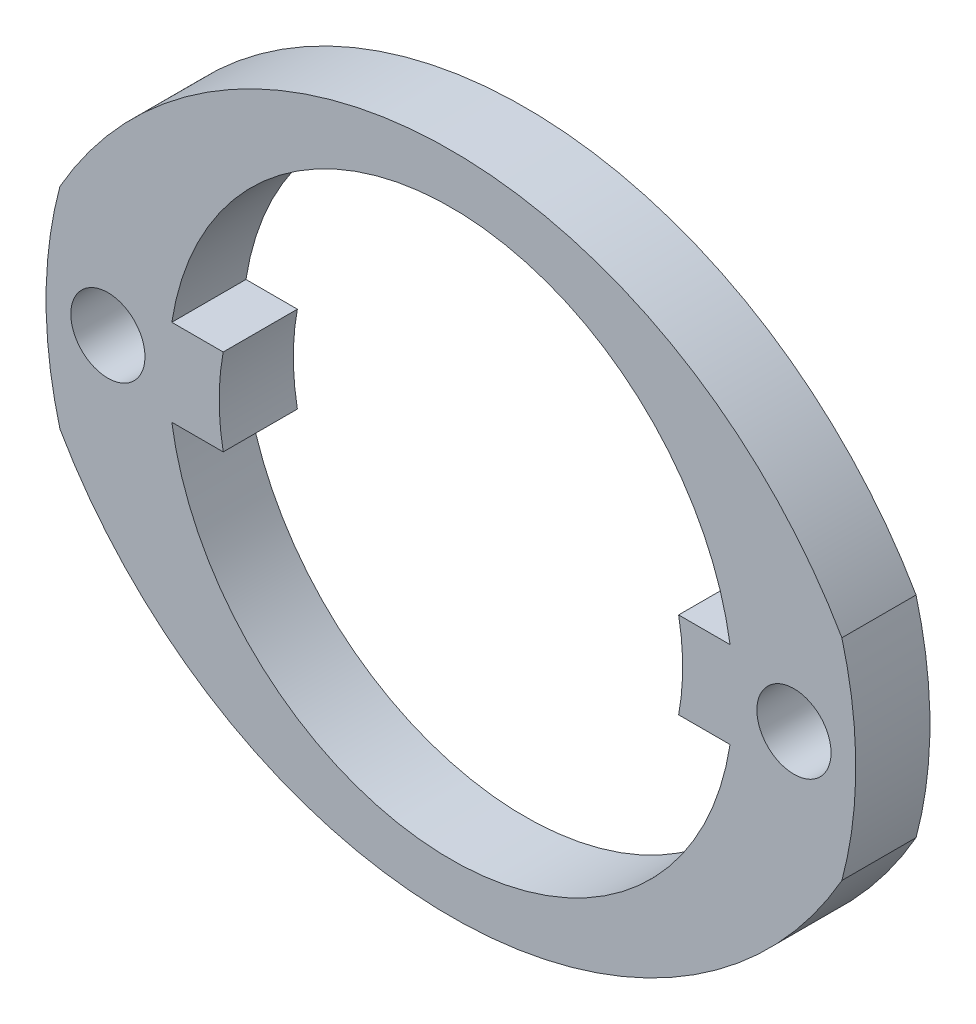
from build123d import *

# Parameters (mm, degrees)
SKETCH1_R           = 1.5
BOSS_EXTRUDE1_DEPTH = 3


with BuildPart() as part:
    # Sketch1 → Boss-Extrude1 (new body)
    with BuildSketch(Plane.XY):
        with BuildLine():
            ThreePointArc((-32.534155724, 4.476054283), (-33.095330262, 0.22593084), (-32.534155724, -4.024192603))
            ThreePointArc((-32.534155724, -4.024192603), (-16.720330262, -13.19906916), (-0.906504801, -4.024192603))
            ThreePointArc((-0.906504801, -4.024192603), (-0.345330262, 0.22593084), (-0.906504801, 4.476054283))
            ThreePointArc((-0.906504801, 4.476054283), (-16.720330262, 13.65093084), (-32.534155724, 4.476054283))
        make_face()
        with Locations((-2.845330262, 0.22593084)):
            Circle(SKETCH1_R, mode=Mode.SUBTRACT)
        with Locations((-30.595330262, 0.22593084)):
            Circle(SKETCH1_R, mode=Mode.SUBTRACT)
        with BuildLine():
            Line((-28.010508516, -1.52406916), (-25.930548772, -1.52406916))
            ThreePointArc((-25.930548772, -1.52406916), (-26.095330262, 0.22593084), (-25.930548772, 1.97593084))
            Line((-25.930548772, 1.97593084), (-28.010508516, 1.97593084))
            ThreePointArc((-28.010508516, 1.97593084), (-16.720330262, 11.65093084), (-5.430152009, 1.97593084))
            Line((-5.430152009, 1.97593084), (-7.510111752, 1.97593084))
            ThreePointArc((-7.510111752, 1.97593084), (-7.345330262, 0.22593084), (-7.510111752, -1.52406916))
            Line((-7.510111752, -1.52406916), (-5.430152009, -1.52406916))
            ThreePointArc((-5.430152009, -1.52406916), (-16.720330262, -11.19906916), (-28.010508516, -1.52406916))
        make_face(mode=Mode.SUBTRACT)
    extrude(amount=BOSS_EXTRUDE1_DEPTH)


solid = part.part
